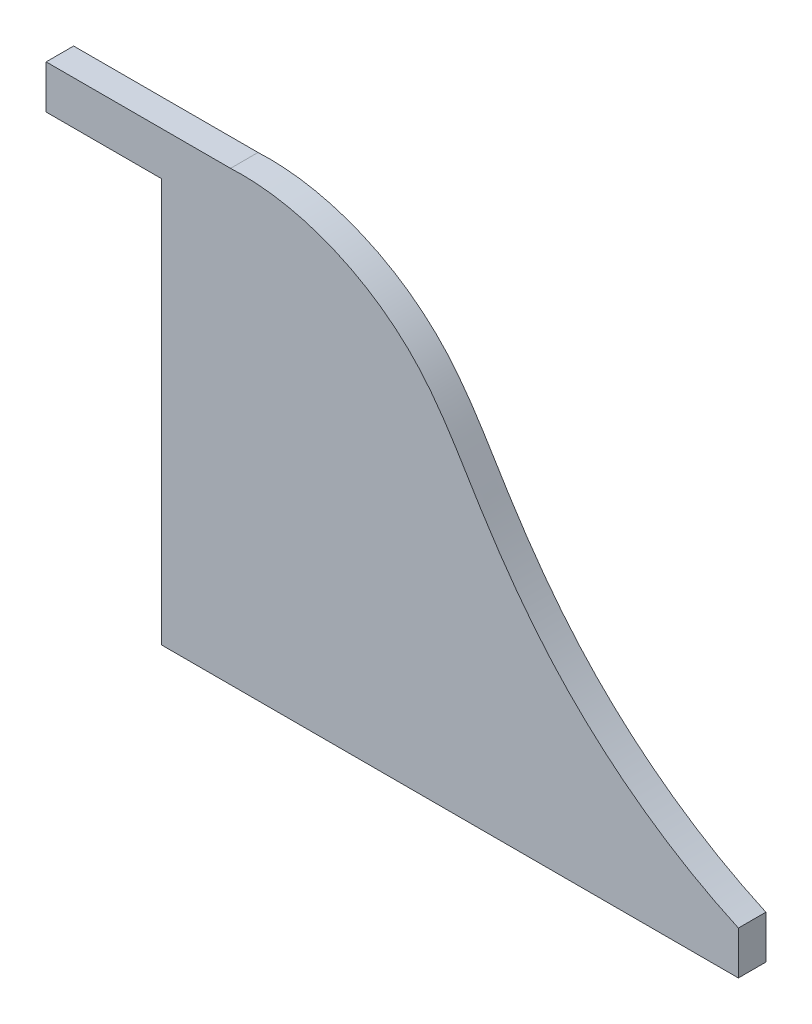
from build123d import *

# Parameters (mm, degrees)
BOSS_EXTRUDE1_DEPTH = 9.525


with BuildPart() as part:
    # Sketch1 → Boss-Extrude1 (new body)
    with BuildSketch(Plane.XY):
        with BuildLine():
            Line((-1218.265649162, 213.561036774), (-1218.265649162, 353.561036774))
            Line((-1218.265649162, 353.561036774), (-1258.265649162, 353.561036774))
            Line((-1258.265649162, 353.561036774), (-1258.265649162, 368.630949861))
            Line((-1258.265649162, 368.630949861), (-1194.331084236, 368.630949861))
            add(Edge.make_bspline(
                [(-1018.265649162, 228.561036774), (-1042.461501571, 239.547804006), (-1076.601248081, 264.676305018), (-1107.912279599, 308.825021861), (-1132.923133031, 354.17339824), (-1170.678726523, 369.83859411), (-1194.331084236, 368.630949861)],
                knots=[0, 0, 0, 0, 0.342591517, 0.530417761, 0.695622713, 1, 1, 1, 1], degree=3))
            Line((-1018.265649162, 228.561036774), (-1018.265649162, 213.561036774))
            Line((-1018.265649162, 213.561036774), (-1218.265649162, 213.561036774))
        make_face()
    extrude(amount=BOSS_EXTRUDE1_DEPTH)


solid = part.part
